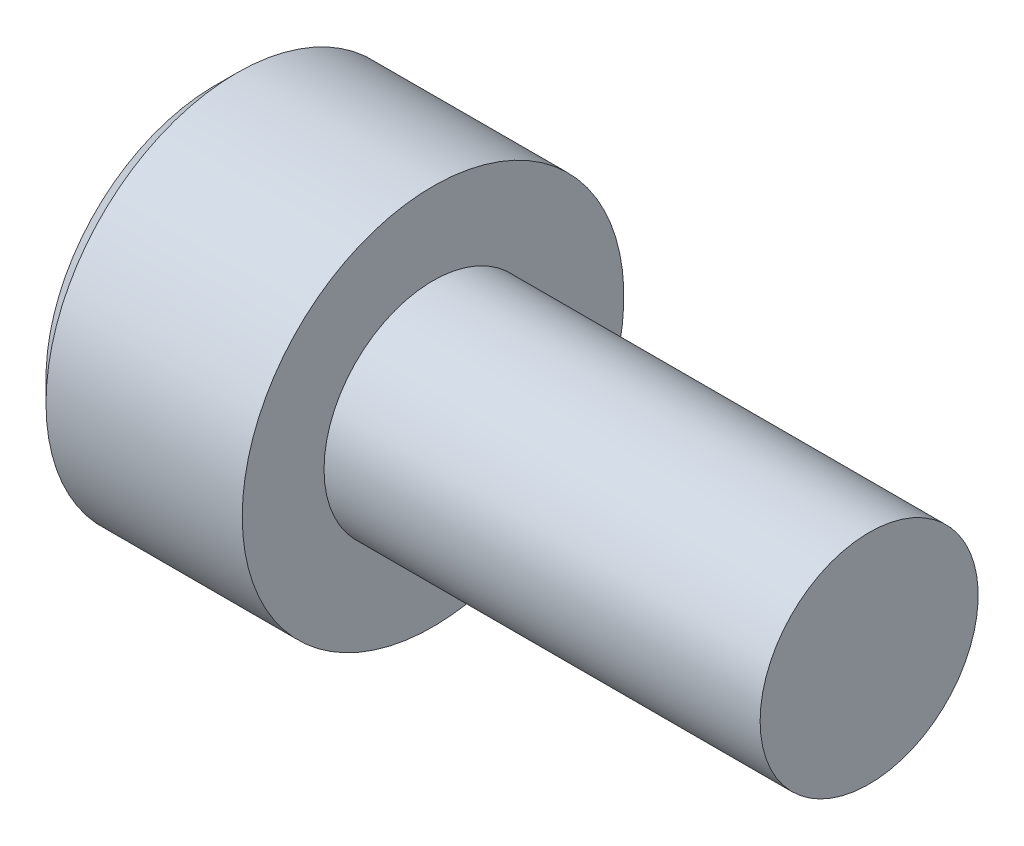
from build123d import *

# Parameters (mm, degrees)
CHAMFER1_SIZE      = 0.4
CUT_EXTRUDE1_DEPTH = 2


with BuildPart() as part:
    # Sketch1 → Revolve1 (revolve)
    with BuildSketch(Plane.XY, mode=Mode.PRIVATE) as revolve1_sk:
        Polygon((-4, 0), (8, 0), (8, 2), (0, 2), (0, 3.5), (-4, 3.5), align=None)
    revolve(revolve1_sk.sketch.rotate(Axis((-4, 0, 0), (1, 0, 0)), 90), axis=Axis((-4, 0, 0), (1, 0, 0)))

    # Chamfer1
    chamfer1_edges = [part.edges().sort_by_distance(p)[0] for p in [
        (-4, 0, -3.5),
    ]]
    chamfer(chamfer1_edges, length=CHAMFER1_SIZE)

    # Sketch2 → Cut-Revolve1 (revolve, cut)
    with BuildSketch(Plane.XY, mode=Mode.PRIVATE) as cut_revolve1_sk:
        Polygon((-1.098709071, 0), (-2, 1.5), (-4, 1.5), (-4, 0), align=None)
    revolve(cut_revolve1_sk.sketch.rotate(Axis((-4, 0, 0), (1, 0, 0)), 180), axis=Axis((-4, 0, 0), (1, 0, 0)), mode=Mode.SUBTRACT)

    # Sketch3 → Cut-Extrude1 (cut)
    with BuildSketch(Plane.ZY.offset(4)):
        Polygon((0, -1.732050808), (1.5, -0.866025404), (1.5, 0.866025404), (0, 1.732050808), (-1.5, 0.866025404), (-1.5, -0.866025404), align=None)
    extrude(amount=-CUT_EXTRUDE1_DEPTH, mode=Mode.SUBTRACT)


solid = part.part
